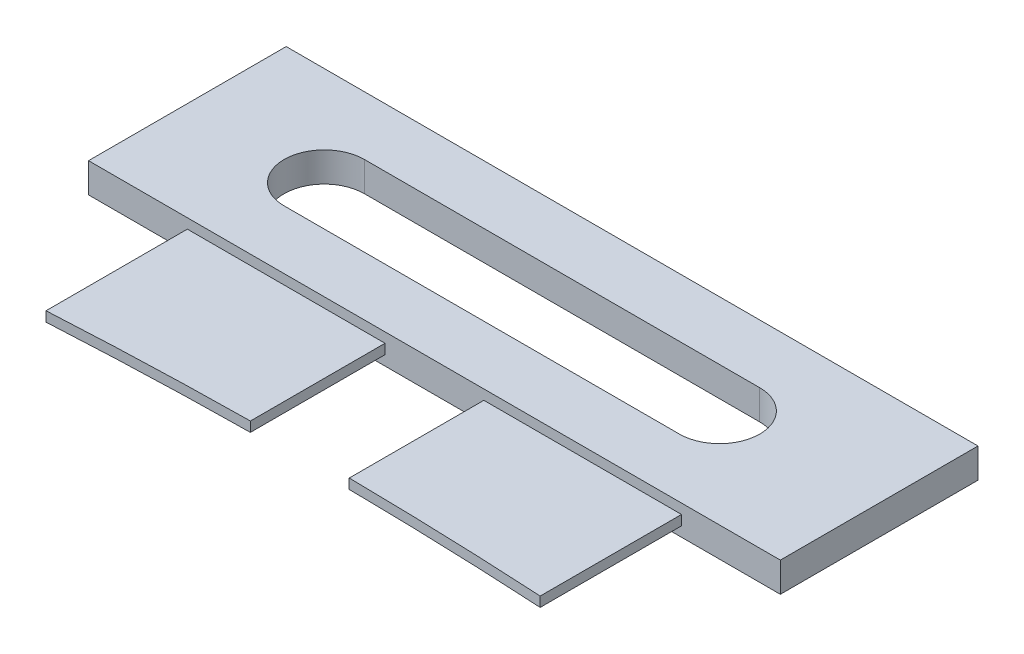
ISO-10303-21;
HEADER;
FILE_DESCRIPTION(('STEP AP214'),'2;1');
FILE_NAME('part.step','',(''),(''),'','','');
FILE_SCHEMA(('AUTOMOTIVE_DESIGN { 1 0 10303 214 1 1 1 1 }'));
ENDSEC;
DATA;
#1=APPLICATION_CONTEXT('core data for automotive mechanical design processes');
#2=APPLICATION_PROTOCOL_DEFINITION('international standard','automotive_design',2000,#1);
#3=PRODUCT_CONTEXT('',#1,'mechanical');
#4=PRODUCT('Part','Part','',(#3));
#5=PRODUCT_RELATED_PRODUCT_CATEGORY('part','',(#4));
#6=PRODUCT_DEFINITION_FORMATION('','',#4);
#7=PRODUCT_DEFINITION_CONTEXT('part definition',#1,'design');
#8=PRODUCT_DEFINITION('design','',#6,#7);
#9=PRODUCT_DEFINITION_SHAPE('','',#8);
#10=(LENGTH_UNIT() NAMED_UNIT(*) SI_UNIT(.MILLI.,.METRE.));
#11=(NAMED_UNIT(*) PLANE_ANGLE_UNIT() SI_UNIT($,.RADIAN.));
#12=(NAMED_UNIT(*) SI_UNIT($,.STERADIAN.) SOLID_ANGLE_UNIT());
#13=UNCERTAINTY_MEASURE_WITH_UNIT(LENGTH_MEASURE(1.E-05),#10,'distance_accuracy_value','');
#14=(GEOMETRIC_REPRESENTATION_CONTEXT(3) GLOBAL_UNCERTAINTY_ASSIGNED_CONTEXT((#13)) GLOBAL_UNIT_ASSIGNED_CONTEXT((#10,
#11,#12)) REPRESENTATION_CONTEXT('',''));
#15=CARTESIAN_POINT('',(0.,0.,0.));
#16=DIRECTION('',(0.,0.,1.));
#17=DIRECTION('',(1.,0.,0.));
#18=AXIS2_PLACEMENT_3D('',#15,#16,#17);
#19=CARTESIAN_POINT('',(4.99999999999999,0.,37.5015693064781));
#20=DIRECTION('',(0.,1.,0.));
#21=DIRECTION('',(-1.,0.,0.));
#22=AXIS2_PLACEMENT_3D('',#19,#20,#21);
#23=PLANE('',#22);
#24=CARTESIAN_POINT('',(25.0000000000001,0.,-25.7004201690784));
#25=CARTESIAN_POINT('',(18.3078555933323,0.,-26.0799816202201));
#26=CARTESIAN_POINT('',(11.7024739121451,0.,-26.3044116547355));
#27=CARTESIAN_POINT('',(4.99999999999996,0.,-26.3799570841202));
#28=B_SPLINE_CURVE_WITH_KNOTS('',3,(#24,#25,#26,#27),.UNSPECIFIED.,.F.,.F.,(4,4),(0.,1.),.UNSPECIFIED.);
#29=CARTESIAN_POINT('',(4.99999999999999,0.,-26.3799570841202));
#30=VERTEX_POINT('',#29);
#31=CARTESIAN_POINT('',(25.,0.,-25.7004201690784));
#32=VERTEX_POINT('',#31);
#33=EDGE_CURVE('E268',#30,#32,#28,.F.);
#34=ORIENTED_EDGE('',*,*,#33,.T.);
#35=DIRECTION('',(0.,0.,-1.));
#36=VECTOR('',#35,1.);
#37=CARTESIAN_POINT('',(25.,0.,37.5015693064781));
#38=LINE('',#37,#36);
#39=CARTESIAN_POINT('',(25.,0.,-40.));
#40=VERTEX_POINT('',#39);
#41=EDGE_CURVE('E267',#32,#40,#38,.T.);
#42=ORIENTED_EDGE('',*,*,#41,.T.);
#43=DIRECTION('',(1.,0.,0.));
#44=VECTOR('',#43,1.);
#45=CARTESIAN_POINT('',(4.99999999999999,0.,-40.));
#46=LINE('',#45,#44);
#47=CARTESIAN_POINT('',(4.99999999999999,0.,-40.));
#48=VERTEX_POINT('',#47);
#49=EDGE_CURVE('E275',#48,#40,#46,.T.);
#50=ORIENTED_EDGE('',*,*,#49,.F.);
#51=DIRECTION('',(0.,0.,-1.));
#52=VECTOR('',#51,1.);
#53=CARTESIAN_POINT('',(4.99999999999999,0.,37.5015693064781));
#54=LINE('',#53,#52);
#55=EDGE_CURVE('E243',#30,#48,#54,.T.);
#56=ORIENTED_EDGE('',*,*,#55,.F.);
#57=EDGE_LOOP('',(#34,#42,#50,#56));
#58=FACE_BOUND('',#57,.T.);
#59=ADVANCED_FACE('F32',(#58),#23,.T.);
#60=CARTESIAN_POINT('',(4.99999999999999,-1.,37.5015693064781));
#61=DIRECTION('',(-1.,0.,0.));
#62=DIRECTION('',(0.,0.,1.));
#63=AXIS2_PLACEMENT_3D('',#60,#61,#62);
#64=PLANE('',#63);
#65=DIRECTION('',(0.,-1.,0.));
#66=VECTOR('',#65,1.);
#67=CARTESIAN_POINT('',(4.99999999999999,4.61643110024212,-26.3799570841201));
#68=LINE('',#67,#66);
#69=CARTESIAN_POINT('',(4.99999999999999,-1.,-26.3799570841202));
#70=VERTEX_POINT('',#69);
#71=EDGE_CURVE('E265',#70,#30,#68,.F.);
#72=ORIENTED_EDGE('',*,*,#71,.T.);
#73=ORIENTED_EDGE('',*,*,#55,.T.);
#74=DIRECTION('',(0.,1.,0.));
#75=VECTOR('',#74,1.);
#76=CARTESIAN_POINT('',(4.99999999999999,-1.,-40.));
#77=LINE('',#76,#75);
#78=CARTESIAN_POINT('',(4.99999999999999,-1.,-40.));
#79=VERTEX_POINT('',#78);
#80=EDGE_CURVE('E11',#79,#48,#77,.T.);
#81=ORIENTED_EDGE('',*,*,#80,.F.);
#82=DIRECTION('',(0.,0.,-1.));
#83=VECTOR('',#82,1.);
#84=CARTESIAN_POINT('',(4.99999999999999,-1.,37.5015693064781));
#85=LINE('',#84,#83);
#86=EDGE_CURVE('E255',#70,#79,#85,.T.);
#87=ORIENTED_EDGE('',*,*,#86,.F.);
#88=EDGE_LOOP('',(#72,#73,#81,#87));
#89=FACE_BOUND('',#88,.T.);
#90=ADVANCED_FACE('F236',(#89),#64,.T.);
#91=CARTESIAN_POINT('',(25.,-1.,37.5015693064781));
#92=DIRECTION('',(0.,-1.,0.));
#93=DIRECTION('',(0.,0.,-1.));
#94=AXIS2_PLACEMENT_3D('',#91,#92,#93);
#95=PLANE('',#94);
#96=CARTESIAN_POINT('',(4.9999999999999,-1.,-26.3799570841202));
#97=CARTESIAN_POINT('',(11.7024739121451,-1.,-26.3044116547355));
#98=CARTESIAN_POINT('',(18.3078555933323,-1.,-26.0799816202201));
#99=CARTESIAN_POINT('',(25.,-1.,-25.7004201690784));
#100=B_SPLINE_CURVE_WITH_KNOTS('',3,(#96,#97,#98,#99),.UNSPECIFIED.,.F.,.F.,(4,4),(0.,1.),.UNSPECIFIED.);
#101=CARTESIAN_POINT('',(25.,-1.,-25.7004201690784));
#102=VERTEX_POINT('',#101);
#103=EDGE_CURVE('E253',#102,#70,#100,.F.);
#104=ORIENTED_EDGE('',*,*,#103,.T.);
#105=ORIENTED_EDGE('',*,*,#86,.T.);
#106=DIRECTION('',(-1.,0.,0.));
#107=VECTOR('',#106,1.);
#108=CARTESIAN_POINT('',(25.,-1.,-40.));
#109=LINE('',#108,#107);
#110=CARTESIAN_POINT('',(25.,-1.,-40.));
#111=VERTEX_POINT('',#110);
#112=EDGE_CURVE('E44',#111,#79,#109,.T.);
#113=ORIENTED_EDGE('',*,*,#112,.F.);
#114=DIRECTION('',(0.,0.,-1.));
#115=VECTOR('',#114,1.);
#116=CARTESIAN_POINT('',(25.,-1.,37.5015693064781));
#117=LINE('',#116,#115);
#118=EDGE_CURVE('E258',#102,#111,#117,.T.);
#119=ORIENTED_EDGE('',*,*,#118,.F.);
#120=EDGE_LOOP('',(#104,#105,#113,#119));
#121=FACE_BOUND('',#120,.T.);
#122=ADVANCED_FACE('F231',(#121),#95,.T.);
#123=CARTESIAN_POINT('',(25.,0.,37.5015693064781));
#124=DIRECTION('',(1.,0.,0.));
#125=DIRECTION('',(0.,1.,0.));
#126=AXIS2_PLACEMENT_3D('',#123,#124,#125);
#127=PLANE('',#126);
#128=DIRECTION('',(0.,-1.,0.));
#129=VECTOR('',#128,1.);
#130=CARTESIAN_POINT('',(25.,4.61643110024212,-25.7004201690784));
#131=LINE('',#130,#129);
#132=EDGE_CURVE('E257',#32,#102,#131,.T.);
#133=ORIENTED_EDGE('',*,*,#132,.T.);
#134=ORIENTED_EDGE('',*,*,#118,.T.);
#135=DIRECTION('',(0.,-1.,0.));
#136=VECTOR('',#135,1.);
#137=CARTESIAN_POINT('',(25.,0.,-40.));
#138=LINE('',#137,#136);
#139=EDGE_CURVE('E272',#40,#111,#138,.T.);
#140=ORIENTED_EDGE('',*,*,#139,.F.);
#141=ORIENTED_EDGE('',*,*,#41,.F.);
#142=EDGE_LOOP('',(#133,#134,#140,#141));
#143=FACE_BOUND('',#142,.T.);
#144=ADVANCED_FACE('F228',(#143),#127,.T.);
#145=CARTESIAN_POINT('',(25.,-1.,-25.7004201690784));
#146=CARTESIAN_POINT('',(25.,-0.666666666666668,-25.7004201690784));
#147=CARTESIAN_POINT('',(25.0000000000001,-0.333333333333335,-25.7004201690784));
#148=CARTESIAN_POINT('',(25.0000000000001,0.,-25.7004201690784));
#149=CARTESIAN_POINT('',(18.3078555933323,-1.,-26.0799816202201));
#150=CARTESIAN_POINT('',(18.3078555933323,-0.666666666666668,-26.0799816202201));
#151=CARTESIAN_POINT('',(18.3078555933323,-0.333333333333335,-26.0799816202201));
#152=CARTESIAN_POINT('',(18.3078555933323,0.,-26.0799816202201));
#153=CARTESIAN_POINT('',(11.7024739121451,-1.,-26.3044116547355));
#154=CARTESIAN_POINT('',(11.7024739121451,-0.666666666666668,-26.3044116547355));
#155=CARTESIAN_POINT('',(11.7024739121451,-0.333333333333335,-26.3044116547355));
#156=CARTESIAN_POINT('',(11.7024739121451,0.,-26.3044116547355));
#157=CARTESIAN_POINT('',(4.9999999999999,-1.,-26.3799570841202));
#158=CARTESIAN_POINT('',(4.99999999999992,-0.666666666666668,-26.3799570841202));
#159=CARTESIAN_POINT('',(4.99999999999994,-0.333333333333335,-26.3799570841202));
#160=CARTESIAN_POINT('',(4.99999999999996,0.,-26.3799570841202));
#161=B_SPLINE_SURFACE_WITH_KNOTS('',3,3,((#145,#146,#147,#148),(#149,#150,#151,#152),(#153,#154,
#155,#156),(#157,#158,#159,#160)),.UNSPECIFIED.,.F.,.F.,.F.,(4,4),(4,4),(0.,1.),(0.,1.),.UNSPECIFIED.);
#162=ORIENTED_EDGE('',*,*,#103,.F.);
#163=ORIENTED_EDGE('',*,*,#132,.F.);
#164=ORIENTED_EDGE('',*,*,#33,.F.);
#165=ORIENTED_EDGE('',*,*,#71,.F.);
#166=EDGE_LOOP('',(#162,#163,#164,#165));
#167=FACE_BOUND('',#166,.T.);
#168=ADVANCED_FACE('F34',(#167),#161,.F.);
#169=CARTESIAN_POINT('',(35.,1.00000000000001,-60.));
#170=DIRECTION('',(-1.,0.,0.));
#171=DIRECTION('',(0.,0.,1.));
#172=AXIS2_PLACEMENT_3D('',#169,#170,#171);
#173=PLANE('',#172);
#174=DIRECTION('',(0.,-1.,0.));
#175=VECTOR('',#174,1.);
#176=CARTESIAN_POINT('',(35.,1.00000000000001,-40.));
#177=LINE('',#176,#175);
#178=CARTESIAN_POINT('',(35.,1.00000000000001,-40.));
#179=VERTEX_POINT('',#178);
#180=CARTESIAN_POINT('',(35.,-1.99999999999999,-40.));
#181=VERTEX_POINT('',#180);
#182=EDGE_CURVE('E351',#179,#181,#177,.T.);
#183=ORIENTED_EDGE('',*,*,#182,.T.);
#184=DIRECTION('',(0.,0.,1.));
#185=VECTOR('',#184,1.);
#186=CARTESIAN_POINT('',(35.,-1.99999999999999,-60.));
#187=LINE('',#186,#185);
#188=CARTESIAN_POINT('',(35.,-1.99999999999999,-60.));
#189=VERTEX_POINT('',#188);
#190=EDGE_CURVE('E313',#189,#181,#187,.T.);
#191=ORIENTED_EDGE('',*,*,#190,.F.);
#192=DIRECTION('',(0.,-1.,0.));
#193=VECTOR('',#192,1.);
#194=CARTESIAN_POINT('',(35.,1.00000000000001,-60.));
#195=LINE('',#194,#193);
#196=CARTESIAN_POINT('',(35.,1.00000000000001,-60.));
#197=VERTEX_POINT('',#196);
#198=EDGE_CURVE('E346',#197,#189,#195,.T.);
#199=ORIENTED_EDGE('',*,*,#198,.F.);
#200=DIRECTION('',(0.,0.,1.));
#201=VECTOR('',#200,1.);
#202=CARTESIAN_POINT('',(35.,1.00000000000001,-60.));
#203=LINE('',#202,#201);
#204=EDGE_CURVE('E340',#197,#179,#203,.T.);
#205=ORIENTED_EDGE('',*,*,#204,.T.);
#206=EDGE_LOOP('',(#183,#191,#199,#205));
#207=FACE_BOUND('',#206,.T.);
#208=ADVANCED_FACE('F224',(#207),#173,.F.);
#209=CARTESIAN_POINT('',(35.,-1.99999999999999,-60.));
#210=DIRECTION('',(0.,1.,0.));
#211=DIRECTION('',(0.,0.,1.));
#212=AXIS2_PLACEMENT_3D('',#209,#210,#211);
#213=PLANE('',#212);
#214=DIRECTION('',(-1.,0.,0.));
#215=VECTOR('',#214,1.);
#216=CARTESIAN_POINT('',(-21.1477112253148,-1.99999999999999,-54.0639171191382));
#217=LINE('',#216,#215);
#218=CARTESIAN_POINT('',(18.8522887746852,-1.99999999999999,-54.0639171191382));
#219=VERTEX_POINT('',#218);
#220=CARTESIAN_POINT('',(-21.1477112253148,-1.99999999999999,-54.0639171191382));
#221=VERTEX_POINT('',#220);
#222=EDGE_CURVE('E158',#219,#221,#217,.T.);
#223=ORIENTED_EDGE('',*,*,#222,.T.);
#224=CARTESIAN_POINT('',(-21.1477112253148,-1.99999999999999,-50.));
#225=DIRECTION('',(0.,1.,0.));
#226=DIRECTION('',(0.,0.,1.));
#227=AXIS2_PLACEMENT_3D('',#224,#225,#226);
#228=CIRCLE('',#227,4.06391711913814);
#229=CARTESIAN_POINT('',(-21.1477112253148,-1.99999999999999,-45.9360828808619));
#230=VERTEX_POINT('',#229);
#231=EDGE_CURVE('E152',#221,#230,#228,.T.);
#232=ORIENTED_EDGE('',*,*,#231,.T.);
#233=DIRECTION('',(1.,0.,0.));
#234=VECTOR('',#233,1.);
#235=CARTESIAN_POINT('',(-21.1477112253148,-1.99999999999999,-45.9360828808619));
#236=LINE('',#235,#234);
#237=CARTESIAN_POINT('',(18.8522887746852,-1.99999999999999,-45.9360828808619));
#238=VERTEX_POINT('',#237);
#239=EDGE_CURVE('E161',#230,#238,#236,.T.);
#240=ORIENTED_EDGE('',*,*,#239,.T.);
#241=CARTESIAN_POINT('',(18.8522887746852,-1.99999999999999,-50.));
#242=DIRECTION('',(0.,1.,0.));
#243=DIRECTION('',(0.,0.,1.));
#244=AXIS2_PLACEMENT_3D('',#241,#242,#243);
#245=CIRCLE('',#244,4.06391711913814);
#246=EDGE_CURVE('E52',#238,#219,#245,.T.);
#247=ORIENTED_EDGE('',*,*,#246,.T.);
#248=EDGE_LOOP('',(#223,#232,#240,#247));
#249=FACE_BOUND('',#248,.T.);
#250=DIRECTION('',(-1.,0.,0.));
#251=VECTOR('',#250,1.);
#252=CARTESIAN_POINT('',(35.,-1.99999999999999,-40.));
#253=LINE('',#252,#251);
#254=CARTESIAN_POINT('',(-35.,-1.99999999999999,-40.));
#255=VERTEX_POINT('',#254);
#256=EDGE_CURVE('E349',#181,#255,#253,.T.);
#257=ORIENTED_EDGE('',*,*,#256,.T.);
#258=DIRECTION('',(0.,0.,1.));
#259=VECTOR('',#258,1.);
#260=CARTESIAN_POINT('',(-35.,-1.99999999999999,-60.));
#261=LINE('',#260,#259);
#262=CARTESIAN_POINT('',(-35.,-1.99999999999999,-60.));
#263=VERTEX_POINT('',#262);
#264=EDGE_CURVE('E334',#263,#255,#261,.T.);
#265=ORIENTED_EDGE('',*,*,#264,.F.);
#266=DIRECTION('',(-1.,0.,0.));
#267=VECTOR('',#266,1.);
#268=CARTESIAN_POINT('',(35.,-1.99999999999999,-60.));
#269=LINE('',#268,#267);
#270=EDGE_CURVE('E358',#189,#263,#269,.T.);
#271=ORIENTED_EDGE('',*,*,#270,.F.);
#272=ORIENTED_EDGE('',*,*,#190,.T.);
#273=EDGE_LOOP('',(#257,#265,#271,#272));
#274=FACE_BOUND('',#273,.T.);
#275=ADVANCED_FACE('F165',(#249,#274),#213,.F.);
#276=CARTESIAN_POINT('',(-35.,1.00000000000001,-60.));
#277=DIRECTION('',(1.,0.,0.));
#278=DIRECTION('',(0.,0.,-1.));
#279=AXIS2_PLACEMENT_3D('',#276,#277,#278);
#280=PLANE('',#279);
#281=DIRECTION('',(0.,1.,0.));
#282=VECTOR('',#281,1.);
#283=CARTESIAN_POINT('',(-35.,1.00000000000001,-40.));
#284=LINE('',#283,#282);
#285=CARTESIAN_POINT('',(-35.,1.00000000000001,-40.));
#286=VERTEX_POINT('',#285);
#287=EDGE_CURVE('E347',#255,#286,#284,.T.);
#288=ORIENTED_EDGE('',*,*,#287,.T.);
#289=DIRECTION('',(0.,0.,1.));
#290=VECTOR('',#289,1.);
#291=CARTESIAN_POINT('',(-35.,1.00000000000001,-60.));
#292=LINE('',#291,#290);
#293=CARTESIAN_POINT('',(-35.,1.00000000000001,-60.));
#294=VERTEX_POINT('',#293);
#295=EDGE_CURVE('E337',#294,#286,#292,.T.);
#296=ORIENTED_EDGE('',*,*,#295,.F.);
#297=DIRECTION('',(0.,1.,0.));
#298=VECTOR('',#297,1.);
#299=CARTESIAN_POINT('',(-35.,1.00000000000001,-60.));
#300=LINE('',#299,#298);
#301=EDGE_CURVE('E356',#263,#294,#300,.T.);
#302=ORIENTED_EDGE('',*,*,#301,.F.);
#303=ORIENTED_EDGE('',*,*,#264,.T.);
#304=EDGE_LOOP('',(#288,#296,#302,#303));
#305=FACE_BOUND('',#304,.T.);
#306=ADVANCED_FACE('F217',(#305),#280,.F.);
#307=CARTESIAN_POINT('',(35.,1.00000000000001,-60.));
#308=DIRECTION('',(0.,-1.,0.));
#309=DIRECTION('',(0.,0.,-1.));
#310=AXIS2_PLACEMENT_3D('',#307,#308,#309);
#311=PLANE('',#310);
#312=DIRECTION('',(1.,0.,0.));
#313=VECTOR('',#312,1.);
#314=CARTESIAN_POINT('',(-21.1477112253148,1.00000000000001,-45.9360828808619));
#315=LINE('',#314,#313);
#316=CARTESIAN_POINT('',(-21.1477112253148,1.00000000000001,-45.9360828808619));
#317=VERTEX_POINT('',#316);
#318=CARTESIAN_POINT('',(18.8522887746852,1.00000000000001,-45.9360828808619));
#319=VERTEX_POINT('',#318);
#320=EDGE_CURVE('E177',#317,#319,#315,.T.);
#321=ORIENTED_EDGE('',*,*,#320,.F.);
#322=CARTESIAN_POINT('',(-21.1477112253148,1.00000000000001,-50.));
#323=DIRECTION('',(0.,1.,0.));
#324=DIRECTION('',(0.,0.,1.));
#325=AXIS2_PLACEMENT_3D('',#322,#323,#324);
#326=CIRCLE('',#325,4.06391711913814);
#327=CARTESIAN_POINT('',(-21.1477112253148,1.00000000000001,-54.0639171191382));
#328=VERTEX_POINT('',#327);
#329=EDGE_CURVE('E60',#328,#317,#326,.T.);
#330=ORIENTED_EDGE('',*,*,#329,.F.);
#331=DIRECTION('',(-1.,0.,0.));
#332=VECTOR('',#331,1.);
#333=CARTESIAN_POINT('',(-21.1477112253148,1.00000000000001,-54.0639171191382));
#334=LINE('',#333,#332);
#335=CARTESIAN_POINT('',(18.8522887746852,1.00000000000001,-54.0639171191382));
#336=VERTEX_POINT('',#335);
#337=EDGE_CURVE('E168',#336,#328,#334,.T.);
#338=ORIENTED_EDGE('',*,*,#337,.F.);
#339=CARTESIAN_POINT('',(18.8522887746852,1.00000000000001,-50.));
#340=DIRECTION('',(0.,1.,0.));
#341=DIRECTION('',(0.,0.,1.));
#342=AXIS2_PLACEMENT_3D('',#339,#340,#341);
#343=CIRCLE('',#342,4.06391711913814);
#344=EDGE_CURVE('E171',#319,#336,#343,.T.);
#345=ORIENTED_EDGE('',*,*,#344,.F.);
#346=EDGE_LOOP('',(#321,#330,#338,#345));
#347=FACE_BOUND('',#346,.T.);
#348=DIRECTION('',(1.,0.,0.));
#349=VECTOR('',#348,1.);
#350=CARTESIAN_POINT('',(35.,1.00000000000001,-40.));
#351=LINE('',#350,#349);
#352=EDGE_CURVE('E344',#286,#179,#351,.T.);
#353=ORIENTED_EDGE('',*,*,#352,.T.);
#354=ORIENTED_EDGE('',*,*,#204,.F.);
#355=DIRECTION('',(1.,0.,0.));
#356=VECTOR('',#355,1.);
#357=CARTESIAN_POINT('',(35.,1.00000000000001,-60.));
#358=LINE('',#357,#356);
#359=EDGE_CURVE('E343',#294,#197,#358,.T.);
#360=ORIENTED_EDGE('',*,*,#359,.F.);
#361=ORIENTED_EDGE('',*,*,#295,.T.);
#362=EDGE_LOOP('',(#353,#354,#360,#361));
#363=FACE_BOUND('',#362,.T.);
#364=ADVANCED_FACE('F210',(#347,#363),#311,.F.);
#365=CARTESIAN_POINT('',(0.,0.,-60.));
#366=DIRECTION('',(0.,0.,-1.));
#367=DIRECTION('',(-1.,0.,0.));
#368=AXIS2_PLACEMENT_3D('',#365,#366,#367);
#369=PLANE('',#368);
#370=ORIENTED_EDGE('',*,*,#198,.T.);
#371=ORIENTED_EDGE('',*,*,#270,.T.);
#372=ORIENTED_EDGE('',*,*,#301,.T.);
#373=ORIENTED_EDGE('',*,*,#359,.T.);
#374=EDGE_LOOP('',(#370,#371,#372,#373));
#375=FACE_BOUND('',#374,.T.);
#376=ADVANCED_FACE('F207',(#375),#369,.T.);
#377=CARTESIAN_POINT('',(0.,0.,-40.));
#378=DIRECTION('',(0.,0.,-1.));
#379=DIRECTION('',(-1.,0.,0.));
#380=AXIS2_PLACEMENT_3D('',#377,#378,#379);
#381=PLANE('',#380);
#382=DIRECTION('',(0.,1.,0.));
#383=VECTOR('',#382,1.);
#384=CARTESIAN_POINT('',(-25.,-1.,-40.));
#385=LINE('',#384,#383);
#386=CARTESIAN_POINT('',(-25.,-1.,-40.));
#387=VERTEX_POINT('',#386);
#388=CARTESIAN_POINT('',(-25.,0.,-40.));
#389=VERTEX_POINT('',#388);
#390=EDGE_CURVE('E354',#387,#389,#385,.T.);
#391=ORIENTED_EDGE('',*,*,#390,.T.);
#392=DIRECTION('',(1.,0.,0.));
#393=VECTOR('',#392,1.);
#394=CARTESIAN_POINT('',(-25.,0.,-40.));
#395=LINE('',#394,#393);
#396=CARTESIAN_POINT('',(-5.00000000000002,0.,-40.));
#397=VERTEX_POINT('',#396);
#398=EDGE_CURVE('E371',#389,#397,#395,.T.);
#399=ORIENTED_EDGE('',*,*,#398,.T.);
#400=DIRECTION('',(1.05818132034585E-13,-1.,0.));
#401=VECTOR('',#400,1.);
#402=CARTESIAN_POINT('',(-5.00000000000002,0.,-40.));
#403=LINE('',#402,#401);
#404=CARTESIAN_POINT('',(-4.99999999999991,-1.,-40.));
#405=VERTEX_POINT('',#404);
#406=EDGE_CURVE('E451',#397,#405,#403,.T.);
#407=ORIENTED_EDGE('',*,*,#406,.T.);
#408=DIRECTION('',(-1.,0.,0.));
#409=VECTOR('',#408,1.);
#410=CARTESIAN_POINT('',(-4.99999999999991,-1.,-40.));
#411=LINE('',#410,#409);
#412=EDGE_CURVE('E452',#405,#387,#411,.T.);
#413=ORIENTED_EDGE('',*,*,#412,.T.);
#414=EDGE_LOOP('',(#391,#399,#407,#413));
#415=FACE_BOUND('',#414,.T.);
#416=ORIENTED_EDGE('',*,*,#49,.T.);
#417=ORIENTED_EDGE('',*,*,#139,.T.);
#418=ORIENTED_EDGE('',*,*,#112,.T.);
#419=ORIENTED_EDGE('',*,*,#80,.T.);
#420=EDGE_LOOP('',(#416,#417,#418,#419));
#421=FACE_BOUND('',#420,.T.);
#422=ORIENTED_EDGE('',*,*,#182,.F.);
#423=ORIENTED_EDGE('',*,*,#352,.F.);
#424=ORIENTED_EDGE('',*,*,#287,.F.);
#425=ORIENTED_EDGE('',*,*,#256,.F.);
#426=EDGE_LOOP('',(#422,#423,#424,#425));
#427=FACE_BOUND('',#426,.T.);
#428=ADVANCED_FACE('F204',(#415,#421,#427),#381,.F.);
#429=CARTESIAN_POINT('',(-25.,0.,37.5015693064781));
#430=DIRECTION('',(0.,1.,0.));
#431=DIRECTION('',(0.,0.,1.));
#432=AXIS2_PLACEMENT_3D('',#429,#430,#431);
#433=PLANE('',#432);
#434=CARTESIAN_POINT('',(-5.00000000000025,0.,-26.3792728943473));
#435=CARTESIAN_POINT('',(-11.7024945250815,0.,-26.3028099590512));
#436=CARTESIAN_POINT('',(-18.307876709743,0.,-26.0774742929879));
#437=CARTESIAN_POINT('',(-25.,0.,-25.6969939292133));
#438=B_SPLINE_CURVE_WITH_KNOTS('',3,(#434,#435,#436,#437),.UNSPECIFIED.,.F.,.F.,(4,4),(0.,1.),.UNSPECIFIED.);
#439=CARTESIAN_POINT('',(-25.,0.,-25.6969939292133));
#440=VERTEX_POINT('',#439);
#441=CARTESIAN_POINT('',(-5.00000000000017,0.,-26.3792728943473));
#442=VERTEX_POINT('',#441);
#443=EDGE_CURVE('E183',#440,#442,#438,.F.);
#444=ORIENTED_EDGE('',*,*,#443,.T.);
#445=DIRECTION('',(0.,0.,-1.));
#446=VECTOR('',#445,1.);
#447=CARTESIAN_POINT('',(-5.00000000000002,0.,37.5015693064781));
#448=LINE('',#447,#446);
#449=EDGE_CURVE('E375',#442,#397,#448,.T.);
#450=ORIENTED_EDGE('',*,*,#449,.T.);
#451=ORIENTED_EDGE('',*,*,#398,.F.);
#452=DIRECTION('',(0.,0.,-1.));
#453=VECTOR('',#452,1.);
#454=CARTESIAN_POINT('',(-25.,0.,37.5015693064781));
#455=LINE('',#454,#453);
#456=EDGE_CURVE('E384',#440,#389,#455,.T.);
#457=ORIENTED_EDGE('',*,*,#456,.F.);
#458=EDGE_LOOP('',(#444,#450,#451,#457));
#459=FACE_BOUND('',#458,.T.);
#460=ADVANCED_FACE('F193',(#459),#433,.T.);
#461=CARTESIAN_POINT('',(-25.,-1.,37.5015693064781));
#462=DIRECTION('',(-1.,0.,0.));
#463=DIRECTION('',(0.,0.,1.));
#464=AXIS2_PLACEMENT_3D('',#461,#462,#463);
#465=PLANE('',#464);
#466=DIRECTION('',(0.,-1.,0.));
#467=VECTOR('',#466,1.);
#468=CARTESIAN_POINT('',(-25.,4.61643110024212,-25.6969939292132));
#469=LINE('',#468,#467);
#470=CARTESIAN_POINT('',(-25.,-1.,-25.6969939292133));
#471=VERTEX_POINT('',#470);
#472=EDGE_CURVE('E378',#471,#440,#469,.F.);
#473=ORIENTED_EDGE('',*,*,#472,.T.);
#474=ORIENTED_EDGE('',*,*,#456,.T.);
#475=ORIENTED_EDGE('',*,*,#390,.F.);
#476=DIRECTION('',(0.,0.,-1.));
#477=VECTOR('',#476,1.);
#478=CARTESIAN_POINT('',(-25.,-1.,37.5015693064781));
#479=LINE('',#478,#477);
#480=EDGE_CURVE('E373',#471,#387,#479,.T.);
#481=ORIENTED_EDGE('',*,*,#480,.F.);
#482=EDGE_LOOP('',(#473,#474,#475,#481));
#483=FACE_BOUND('',#482,.T.);
#484=ADVANCED_FACE('F203',(#483),#465,.T.);
#485=CARTESIAN_POINT('',(-4.99999999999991,-1.,37.5015693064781));
#486=DIRECTION('',(0.,-1.,0.));
#487=DIRECTION('',(1.,0.,0.));
#488=AXIS2_PLACEMENT_3D('',#485,#486,#487);
#489=PLANE('',#488);
#490=CARTESIAN_POINT('',(-24.9999999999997,-1.,-25.6969939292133));
#491=CARTESIAN_POINT('',(-18.3078767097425,-1.,-26.0774742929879));
#492=CARTESIAN_POINT('',(-11.7024945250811,-1.,-26.3028099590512));
#493=CARTESIAN_POINT('',(-4.9999999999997,-1.,-26.3792728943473));
#494=B_SPLINE_CURVE_WITH_KNOTS('',3,(#490,#491,#492,#493),.UNSPECIFIED.,.F.,.F.,(4,4),(0.,1.),.UNSPECIFIED.);
#495=CARTESIAN_POINT('',(-4.99999999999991,-1.,-26.3792728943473));
#496=VERTEX_POINT('',#495);
#497=EDGE_CURVE('E386',#496,#471,#494,.F.);
#498=ORIENTED_EDGE('',*,*,#497,.T.);
#499=ORIENTED_EDGE('',*,*,#480,.T.);
#500=ORIENTED_EDGE('',*,*,#412,.F.);
#501=DIRECTION('',(0.,0.,-1.));
#502=VECTOR('',#501,1.);
#503=CARTESIAN_POINT('',(-4.99999999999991,-1.,37.5015693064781));
#504=LINE('',#503,#502);
#505=EDGE_CURVE('E367',#496,#405,#504,.T.);
#506=ORIENTED_EDGE('',*,*,#505,.F.);
#507=EDGE_LOOP('',(#498,#499,#500,#506));
#508=FACE_BOUND('',#507,.T.);
#509=ADVANCED_FACE('F389',(#508),#489,.T.);
#510=CARTESIAN_POINT('',(-5.00000000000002,0.,37.5015693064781));
#511=DIRECTION('',(1.,1.05818132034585E-13,0.));
#512=DIRECTION('',(-1.05818132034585E-13,1.,0.));
#513=AXIS2_PLACEMENT_3D('',#510,#511,#512);
#514=PLANE('',#513);
#515=DIRECTION('',(0.,-1.,0.));
#516=VECTOR('',#515,1.);
#517=CARTESIAN_POINT('',(-5.00000000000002,4.61643110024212,-26.3792728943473));
#518=LINE('',#517,#516);
#519=EDGE_CURVE('E372',#442,#496,#518,.T.);
#520=ORIENTED_EDGE('',*,*,#519,.T.);
#521=ORIENTED_EDGE('',*,*,#505,.T.);
#522=ORIENTED_EDGE('',*,*,#406,.F.);
#523=ORIENTED_EDGE('',*,*,#449,.F.);
#524=EDGE_LOOP('',(#520,#521,#522,#523));
#525=FACE_BOUND('',#524,.T.);
#526=ADVANCED_FACE('F398',(#525),#514,.T.);
#527=CARTESIAN_POINT('',(-4.9999999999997,-1.,-26.3792728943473));
#528=CARTESIAN_POINT('',(-4.99999999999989,-0.666666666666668,-26.3792728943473));
#529=CARTESIAN_POINT('',(-5.00000000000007,-0.333333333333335,-26.3792728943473));
#530=CARTESIAN_POINT('',(-5.00000000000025,0.,-26.3792728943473));
#531=CARTESIAN_POINT('',(-11.7024945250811,-1.,-26.3028099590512));
#532=CARTESIAN_POINT('',(-11.7024945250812,-0.666666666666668,-26.3028099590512));
#533=CARTESIAN_POINT('',(-11.7024945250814,-0.333333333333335,-26.3028099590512));
#534=CARTESIAN_POINT('',(-11.7024945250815,0.,-26.3028099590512));
#535=CARTESIAN_POINT('',(-18.3078767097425,-1.,-26.0774742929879));
#536=CARTESIAN_POINT('',(-18.3078767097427,-0.666666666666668,-26.0774742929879));
#537=CARTESIAN_POINT('',(-18.3078767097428,-0.333333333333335,-26.0774742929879));
#538=CARTESIAN_POINT('',(-18.307876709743,0.,-26.0774742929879));
#539=CARTESIAN_POINT('',(-24.9999999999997,-1.,-25.6969939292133));
#540=CARTESIAN_POINT('',(-24.9999999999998,-0.666666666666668,-25.6969939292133));
#541=CARTESIAN_POINT('',(-24.9999999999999,-0.333333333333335,-25.6969939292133));
#542=CARTESIAN_POINT('',(-25.,0.,-25.6969939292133));
#543=B_SPLINE_SURFACE_WITH_KNOTS('',3,3,((#527,#528,#529,#530),(#531,#532,#533,#534),(#535,#536,
#537,#538),(#539,#540,#541,#542)),.UNSPECIFIED.,.F.,.F.,.F.,(4,4),(4,4),(0.,1.),(0.,1.),.UNSPECIFIED.);
#544=ORIENTED_EDGE('',*,*,#497,.F.);
#545=ORIENTED_EDGE('',*,*,#519,.F.);
#546=ORIENTED_EDGE('',*,*,#443,.F.);
#547=ORIENTED_EDGE('',*,*,#472,.F.);
#548=EDGE_LOOP('',(#544,#545,#546,#547));
#549=FACE_BOUND('',#548,.T.);
#550=ADVANCED_FACE('F402',(#549),#543,.F.);
#551=CARTESIAN_POINT('',(-21.1477112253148,-1.99999999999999,-50.));
#552=DIRECTION('',(0.,1.,0.));
#553=DIRECTION('',(0.,0.,1.));
#554=AXIS2_PLACEMENT_3D('',#551,#552,#553);
#555=CYLINDRICAL_SURFACE('',#554,4.06391711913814);
#556=ORIENTED_EDGE('',*,*,#329,.T.);
#557=DIRECTION('',(0.,1.,0.));
#558=VECTOR('',#557,1.);
#559=CARTESIAN_POINT('',(-21.1477112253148,-1.99999999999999,-45.9360828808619));
#560=LINE('',#559,#558);
#561=EDGE_CURVE('E148',#230,#317,#560,.T.);
#562=ORIENTED_EDGE('',*,*,#561,.F.);
#563=ORIENTED_EDGE('',*,*,#231,.F.);
#564=DIRECTION('',(0.,1.,0.));
#565=VECTOR('',#564,1.);
#566=CARTESIAN_POINT('',(-21.1477112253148,-1.99999999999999,-54.0639171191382));
#567=LINE('',#566,#565);
#568=EDGE_CURVE('E181',#221,#328,#567,.T.);
#569=ORIENTED_EDGE('',*,*,#568,.T.);
#570=EDGE_LOOP('',(#556,#562,#563,#569));
#571=FACE_BOUND('',#570,.T.);
#572=ADVANCED_FACE('F150',(#571),#555,.F.);
#573=CARTESIAN_POINT('',(-21.1477112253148,-1.99999999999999,-54.0639171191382));
#574=DIRECTION('',(0.,0.,-1.));
#575=DIRECTION('',(-1.,0.,0.));
#576=AXIS2_PLACEMENT_3D('',#573,#574,#575);
#577=PLANE('',#576);
#578=ORIENTED_EDGE('',*,*,#337,.T.);
#579=ORIENTED_EDGE('',*,*,#568,.F.);
#580=ORIENTED_EDGE('',*,*,#222,.F.);
#581=DIRECTION('',(0.,1.,0.));
#582=VECTOR('',#581,1.);
#583=CARTESIAN_POINT('',(18.8522887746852,-1.99999999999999,-54.0639171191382));
#584=LINE('',#583,#582);
#585=EDGE_CURVE('E184',#219,#336,#584,.T.);
#586=ORIENTED_EDGE('',*,*,#585,.T.);
#587=EDGE_LOOP('',(#578,#579,#580,#586));
#588=FACE_BOUND('',#587,.T.);
#589=ADVANCED_FACE('F477',(#588),#577,.F.);
#590=CARTESIAN_POINT('',(18.8522887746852,-1.99999999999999,-50.));
#591=DIRECTION('',(0.,1.,0.));
#592=DIRECTION('',(0.,0.,1.));
#593=AXIS2_PLACEMENT_3D('',#590,#591,#592);
#594=CYLINDRICAL_SURFACE('',#593,4.06391711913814);
#595=ORIENTED_EDGE('',*,*,#344,.T.);
#596=ORIENTED_EDGE('',*,*,#585,.F.);
#597=ORIENTED_EDGE('',*,*,#246,.F.);
#598=DIRECTION('',(0.,1.,0.));
#599=VECTOR('',#598,1.);
#600=CARTESIAN_POINT('',(18.8522887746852,-1.99999999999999,-45.9360828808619));
#601=LINE('',#600,#599);
#602=EDGE_CURVE('E157',#238,#319,#601,.T.);
#603=ORIENTED_EDGE('',*,*,#602,.T.);
#604=EDGE_LOOP('',(#595,#596,#597,#603));
#605=FACE_BOUND('',#604,.T.);
#606=ADVANCED_FACE('F484',(#605),#594,.F.);
#607=CARTESIAN_POINT('',(-21.1477112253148,-1.99999999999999,-45.9360828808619));
#608=DIRECTION('',(0.,0.,1.));
#609=DIRECTION('',(1.,0.,0.));
#610=AXIS2_PLACEMENT_3D('',#607,#608,#609);
#611=PLANE('',#610);
#612=ORIENTED_EDGE('',*,*,#320,.T.);
#613=ORIENTED_EDGE('',*,*,#602,.F.);
#614=ORIENTED_EDGE('',*,*,#239,.F.);
#615=ORIENTED_EDGE('',*,*,#561,.T.);
#616=EDGE_LOOP('',(#612,#613,#614,#615));
#617=FACE_BOUND('',#616,.T.);
#618=ADVANCED_FACE('F162',(#617),#611,.F.);
#619=CLOSED_SHELL('',(#59,#90,#122,#144,#168,#208,#275,#306,#364,#376,#428,#460,#484,#509,#526,
#550,#572,#589,#606,#618));
#620=MANIFOLD_SOLID_BREP('B2',#619);
#621=ADVANCED_BREP_SHAPE_REPRESENTATION('',(#18,#620),#14);
#622=SHAPE_DEFINITION_REPRESENTATION(#9,#621);
ENDSEC;
END-ISO-10303-21;
